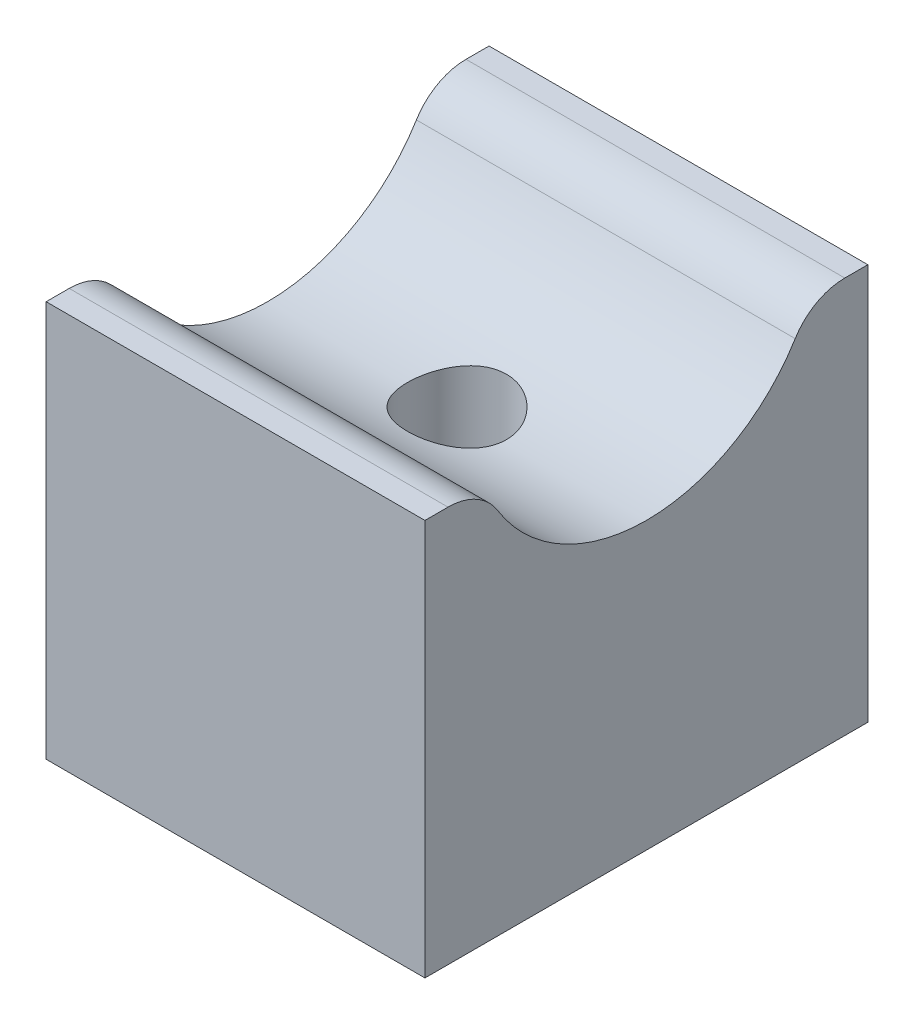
ISO-10303-21;
HEADER;
FILE_DESCRIPTION(('STEP AP214'),'2;1');
FILE_NAME('part.step','',(''),(''),'','','');
FILE_SCHEMA(('AUTOMOTIVE_DESIGN { 1 0 10303 214 1 1 1 1 }'));
ENDSEC;
DATA;
#1=APPLICATION_CONTEXT('core data for automotive mechanical design processes');
#2=APPLICATION_PROTOCOL_DEFINITION('international standard','automotive_design',2000,#1);
#3=PRODUCT_CONTEXT('',#1,'mechanical');
#4=PRODUCT('Part','Part','',(#3));
#5=PRODUCT_RELATED_PRODUCT_CATEGORY('part','',(#4));
#6=PRODUCT_DEFINITION_FORMATION('','',#4);
#7=PRODUCT_DEFINITION_CONTEXT('part definition',#1,'design');
#8=PRODUCT_DEFINITION('design','',#6,#7);
#9=PRODUCT_DEFINITION_SHAPE('','',#8);
#10=(LENGTH_UNIT() NAMED_UNIT(*) SI_UNIT(.MILLI.,.METRE.));
#11=(NAMED_UNIT(*) PLANE_ANGLE_UNIT() SI_UNIT($,.RADIAN.));
#12=(NAMED_UNIT(*) SI_UNIT($,.STERADIAN.) SOLID_ANGLE_UNIT());
#13=UNCERTAINTY_MEASURE_WITH_UNIT(LENGTH_MEASURE(1.E-05),#10,'distance_accuracy_value','');
#14=(GEOMETRIC_REPRESENTATION_CONTEXT(3) GLOBAL_UNCERTAINTY_ASSIGNED_CONTEXT((#13)) GLOBAL_UNIT_ASSIGNED_CONTEXT((#10,
#11,#12)) REPRESENTATION_CONTEXT('',''));
#15=CARTESIAN_POINT('',(0.,0.,0.));
#16=DIRECTION('',(0.,0.,1.));
#17=DIRECTION('',(1.,0.,0.));
#18=AXIS2_PLACEMENT_3D('',#15,#16,#17);
#19=CARTESIAN_POINT('',(16.25,34.,19.));
#20=DIRECTION('',(0.,1.,0.));
#21=DIRECTION('',(0.,0.,1.));
#22=AXIS2_PLACEMENT_3D('',#19,#20,#21);
#23=PLANE('',#22);
#24=DIRECTION('',(0.,0.,-1.));
#25=VECTOR('',#24,1.);
#26=CARTESIAN_POINT('',(16.25,34.,-19.));
#27=LINE('',#26,#25);
#28=CARTESIAN_POINT('',(16.25,34.,19.));
#29=VERTEX_POINT('',#28);
#30=CARTESIAN_POINT('',(16.25,34.,17.0220445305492));
#31=VERTEX_POINT('',#30);
#32=EDGE_CURVE('E109',#29,#31,#27,.T.);
#33=ORIENTED_EDGE('',*,*,#32,.T.);
#34=DIRECTION('',(-1.,0.,0.));
#35=VECTOR('',#34,1.);
#36=CARTESIAN_POINT('',(-16.25,34.,17.0220445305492));
#37=LINE('',#36,#35);
#38=CARTESIAN_POINT('',(-16.25,34.,17.0220445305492));
#39=VERTEX_POINT('',#38);
#40=EDGE_CURVE('E11',#31,#39,#37,.T.);
#41=ORIENTED_EDGE('',*,*,#40,.T.);
#42=DIRECTION('',(0.,0.,1.));
#43=VECTOR('',#42,1.);
#44=CARTESIAN_POINT('',(-16.25,34.,-19.));
#45=LINE('',#44,#43);
#46=CARTESIAN_POINT('',(-16.25,34.,19.));
#47=VERTEX_POINT('',#46);
#48=EDGE_CURVE('E120',#39,#47,#45,.T.);
#49=ORIENTED_EDGE('',*,*,#48,.T.);
#50=DIRECTION('',(1.,0.,0.));
#51=VECTOR('',#50,1.);
#52=CARTESIAN_POINT('',(-16.25,34.,19.));
#53=LINE('',#52,#51);
#54=EDGE_CURVE('E158',#47,#29,#53,.T.);
#55=ORIENTED_EDGE('',*,*,#54,.T.);
#56=EDGE_LOOP('',(#33,#41,#49,#55));
#57=FACE_BOUND('',#56,.T.);
#58=ADVANCED_FACE('F34',(#57),#23,.T.);
#59=CARTESIAN_POINT('',(16.25,34.,-19.));
#60=DIRECTION('',(-1.,0.,0.));
#61=DIRECTION('',(0.,0.,1.));
#62=AXIS2_PLACEMENT_3D('',#59,#60,#61);
#63=PLANE('',#62);
#64=CARTESIAN_POINT('',(16.25,34.,-17.0220445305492));
#65=VERTEX_POINT('',#64);
#66=CARTESIAN_POINT('',(16.25,34.,-19.));
#67=VERTEX_POINT('',#66);
#68=EDGE_CURVE('E102',#65,#67,#27,.T.);
#69=ORIENTED_EDGE('',*,*,#68,.F.);
#70=CARTESIAN_POINT('',(16.25,29.,-17.0220445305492));
#71=DIRECTION('',(-1.,0.,0.));
#72=DIRECTION('',(0.,0.,1.));
#73=AXIS2_PLACEMENT_3D('',#70,#71,#72);
#74=CIRCLE('',#73,5.);
#75=CARTESIAN_POINT('',(16.25,31.625,-12.7665333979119));
#76=VERTEX_POINT('',#75);
#77=EDGE_CURVE('E47',#65,#76,#74,.F.);
#78=ORIENTED_EDGE('',*,*,#77,.T.);
#79=CARTESIAN_POINT('',(16.25,39.5,0.));
#80=DIRECTION('',(1.,0.,0.));
#81=DIRECTION('',(0.,0.,-1.));
#82=AXIS2_PLACEMENT_3D('',#79,#80,#81);
#83=CIRCLE('',#82,15.);
#84=CARTESIAN_POINT('',(16.25,31.625,12.7665333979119));
#85=VERTEX_POINT('',#84);
#86=EDGE_CURVE('E144',#85,#76,#83,.T.);
#87=ORIENTED_EDGE('',*,*,#86,.F.);
#88=CARTESIAN_POINT('',(16.25,29.,17.0220445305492));
#89=DIRECTION('',(-1.,0.,0.));
#90=DIRECTION('',(0.,0.,1.));
#91=AXIS2_PLACEMENT_3D('',#88,#89,#90);
#92=CIRCLE('',#91,5.);
#93=EDGE_CURVE('E54',#85,#31,#92,.F.);
#94=ORIENTED_EDGE('',*,*,#93,.T.);
#95=ORIENTED_EDGE('',*,*,#32,.F.);
#96=DIRECTION('',(0.,-1.,0.));
#97=VECTOR('',#96,1.);
#98=CARTESIAN_POINT('',(16.25,34.,19.));
#99=LINE('',#98,#97);
#100=CARTESIAN_POINT('',(16.25,0.,19.));
#101=VERTEX_POINT('',#100);
#102=EDGE_CURVE('E160',#29,#101,#99,.T.);
#103=ORIENTED_EDGE('',*,*,#102,.T.);
#104=DIRECTION('',(0.,0.,-1.));
#105=VECTOR('',#104,1.);
#106=CARTESIAN_POINT('',(16.25,0.,-19.));
#107=LINE('',#106,#105);
#108=CARTESIAN_POINT('',(16.25,0.,-19.));
#109=VERTEX_POINT('',#108);
#110=EDGE_CURVE('E125',#101,#109,#107,.T.);
#111=ORIENTED_EDGE('',*,*,#110,.T.);
#112=DIRECTION('',(0.,-1.,0.));
#113=VECTOR('',#112,1.);
#114=CARTESIAN_POINT('',(16.25,34.,-19.));
#115=LINE('',#114,#113);
#116=EDGE_CURVE('E115',#67,#109,#115,.T.);
#117=ORIENTED_EDGE('',*,*,#116,.F.);
#118=EDGE_LOOP('',(#69,#78,#87,#94,#95,#103,#111,#117));
#119=FACE_BOUND('',#118,.T.);
#120=ADVANCED_FACE('F122',(#119),#63,.F.);
#121=CARTESIAN_POINT('',(-16.25,34.,-19.));
#122=DIRECTION('',(0.,0.,1.));
#123=DIRECTION('',(1.,0.,0.));
#124=AXIS2_PLACEMENT_3D('',#121,#122,#123);
#125=PLANE('',#124);
#126=DIRECTION('',(-1.,0.,0.));
#127=VECTOR('',#126,1.);
#128=CARTESIAN_POINT('',(-16.25,0.,-19.));
#129=LINE('',#128,#127);
#130=CARTESIAN_POINT('',(-16.25,0.,-19.));
#131=VERTEX_POINT('',#130);
#132=EDGE_CURVE('E164',#109,#131,#129,.T.);
#133=ORIENTED_EDGE('',*,*,#132,.T.);
#134=DIRECTION('',(0.,-1.,0.));
#135=VECTOR('',#134,1.);
#136=CARTESIAN_POINT('',(-16.25,34.,-19.));
#137=LINE('',#136,#135);
#138=CARTESIAN_POINT('',(-16.25,34.,-19.));
#139=VERTEX_POINT('',#138);
#140=EDGE_CURVE('E118',#139,#131,#137,.T.);
#141=ORIENTED_EDGE('',*,*,#140,.F.);
#142=DIRECTION('',(-1.,0.,0.));
#143=VECTOR('',#142,1.);
#144=CARTESIAN_POINT('',(-16.25,34.,-19.));
#145=LINE('',#144,#143);
#146=EDGE_CURVE('E105',#67,#139,#145,.T.);
#147=ORIENTED_EDGE('',*,*,#146,.F.);
#148=ORIENTED_EDGE('',*,*,#116,.T.);
#149=EDGE_LOOP('',(#133,#141,#147,#148));
#150=FACE_BOUND('',#149,.T.);
#151=ADVANCED_FACE('F114',(#150),#125,.F.);
#152=CARTESIAN_POINT('',(-16.25,34.,-19.));
#153=DIRECTION('',(1.,0.,0.));
#154=DIRECTION('',(0.,0.,-1.));
#155=AXIS2_PLACEMENT_3D('',#152,#153,#154);
#156=PLANE('',#155);
#157=CARTESIAN_POINT('',(-16.25,39.5,0.));
#158=DIRECTION('',(1.,0.,0.));
#159=DIRECTION('',(0.,0.,-1.));
#160=AXIS2_PLACEMENT_3D('',#157,#158,#159);
#161=CIRCLE('',#160,15.);
#162=CARTESIAN_POINT('',(-16.25,31.625,12.7665333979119));
#163=VERTEX_POINT('',#162);
#164=CARTESIAN_POINT('',(-16.25,31.625,-12.7665333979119));
#165=VERTEX_POINT('',#164);
#166=EDGE_CURVE('E152',#163,#165,#161,.T.);
#167=ORIENTED_EDGE('',*,*,#166,.T.);
#168=CARTESIAN_POINT('',(-16.25,29.,-17.0220445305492));
#169=DIRECTION('',(1.,0.,0.));
#170=DIRECTION('',(0.,0.,-1.));
#171=AXIS2_PLACEMENT_3D('',#168,#169,#170);
#172=CIRCLE('',#171,5.);
#173=CARTESIAN_POINT('',(-16.25,34.,-17.0220445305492));
#174=VERTEX_POINT('',#173);
#175=EDGE_CURVE('E139',#165,#174,#172,.F.);
#176=ORIENTED_EDGE('',*,*,#175,.T.);
#177=EDGE_CURVE('E157',#139,#174,#45,.T.);
#178=ORIENTED_EDGE('',*,*,#177,.F.);
#179=ORIENTED_EDGE('',*,*,#140,.T.);
#180=DIRECTION('',(0.,0.,1.));
#181=VECTOR('',#180,1.);
#182=CARTESIAN_POINT('',(-16.25,0.,-19.));
#183=LINE('',#182,#181);
#184=CARTESIAN_POINT('',(-16.25,0.,19.));
#185=VERTEX_POINT('',#184);
#186=EDGE_CURVE('E166',#131,#185,#183,.T.);
#187=ORIENTED_EDGE('',*,*,#186,.T.);
#188=DIRECTION('',(0.,-1.,0.));
#189=VECTOR('',#188,1.);
#190=CARTESIAN_POINT('',(-16.25,34.,19.));
#191=LINE('',#190,#189);
#192=EDGE_CURVE('E131',#47,#185,#191,.T.);
#193=ORIENTED_EDGE('',*,*,#192,.F.);
#194=ORIENTED_EDGE('',*,*,#48,.F.);
#195=CARTESIAN_POINT('',(-16.25,29.,17.0220445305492));
#196=DIRECTION('',(1.,0.,0.));
#197=DIRECTION('',(0.,0.,-1.));
#198=AXIS2_PLACEMENT_3D('',#195,#196,#197);
#199=CIRCLE('',#198,5.);
#200=EDGE_CURVE('E137',#39,#163,#199,.F.);
#201=ORIENTED_EDGE('',*,*,#200,.T.);
#202=EDGE_LOOP('',(#167,#176,#178,#179,#187,#193,#194,#201));
#203=FACE_BOUND('',#202,.T.);
#204=ADVANCED_FACE('F156',(#203),#156,.F.);
#205=CARTESIAN_POINT('',(-16.25,34.,19.));
#206=DIRECTION('',(0.,0.,-1.));
#207=DIRECTION('',(-1.,0.,0.));
#208=AXIS2_PLACEMENT_3D('',#205,#206,#207);
#209=PLANE('',#208);
#210=DIRECTION('',(1.,0.,0.));
#211=VECTOR('',#210,1.);
#212=CARTESIAN_POINT('',(-16.25,0.,19.));
#213=LINE('',#212,#211);
#214=EDGE_CURVE('E110',#185,#101,#213,.T.);
#215=ORIENTED_EDGE('',*,*,#214,.T.);
#216=ORIENTED_EDGE('',*,*,#102,.F.);
#217=ORIENTED_EDGE('',*,*,#54,.F.);
#218=ORIENTED_EDGE('',*,*,#192,.T.);
#219=EDGE_LOOP('',(#215,#216,#217,#218));
#220=FACE_BOUND('',#219,.T.);
#221=ADVANCED_FACE('F174',(#220),#209,.F.);
#222=ORIENTED_EDGE('',*,*,#177,.T.);
#223=DIRECTION('',(-1.,0.,0.));
#224=VECTOR('',#223,1.);
#225=CARTESIAN_POINT('',(16.25,34.,-17.0220445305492));
#226=LINE('',#225,#224);
#227=EDGE_CURVE('E62',#174,#65,#226,.F.);
#228=ORIENTED_EDGE('',*,*,#227,.T.);
#229=ORIENTED_EDGE('',*,*,#68,.T.);
#230=ORIENTED_EDGE('',*,*,#146,.T.);
#231=EDGE_LOOP('',(#222,#228,#229,#230));
#232=FACE_BOUND('',#231,.T.);
#233=ADVANCED_FACE('F104',(#232),#23,.T.);
#234=CARTESIAN_POINT('',(16.25,0.,19.));
#235=DIRECTION('',(0.,1.,0.));
#236=DIRECTION('',(0.,0.,1.));
#237=AXIS2_PLACEMENT_3D('',#234,#235,#236);
#238=PLANE('',#237);
#239=CARTESIAN_POINT('',(0.,0.,0.));
#240=DIRECTION('',(0.,-1.,0.));
#241=DIRECTION('',(0.,0.,-1.));
#242=AXIS2_PLACEMENT_3D('',#239,#240,#241);
#243=CIRCLE('',#242,7.5);
#244=CARTESIAN_POINT('',(0.,0.,-7.5));
#245=VERTEX_POINT('',#244);
#246=EDGE_CURVE('E217',#245,#245,#243,.T.);
#247=ORIENTED_EDGE('',*,*,#246,.F.);
#248=EDGE_LOOP('',(#247));
#249=FACE_BOUND('',#248,.T.);
#250=ORIENTED_EDGE('',*,*,#110,.F.);
#251=ORIENTED_EDGE('',*,*,#214,.F.);
#252=ORIENTED_EDGE('',*,*,#186,.F.);
#253=ORIENTED_EDGE('',*,*,#132,.F.);
#254=EDGE_LOOP('',(#250,#251,#252,#253));
#255=FACE_BOUND('',#254,.T.);
#256=ADVANCED_FACE('F179',(#249,#255),#238,.F.);
#257=CARTESIAN_POINT('',(-16.25,39.5,0.));
#258=DIRECTION('',(1.,0.,0.));
#259=DIRECTION('',(0.,0.,-1.));
#260=AXIS2_PLACEMENT_3D('',#257,#258,#259);
#261=CYLINDRICAL_SURFACE('',#260,15.);
#262=CARTESIAN_POINT('',(0.,25.1146776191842,-4.25));
#263=CARTESIAN_POINT('',(0.233523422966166,25.1146742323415,-4.24999559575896));
#264=CARTESIAN_POINT('',(0.467091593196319,25.1089290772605,-4.23068745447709));
#265=CARTESIAN_POINT('',(0.927442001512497,25.0866489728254,-4.1541366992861));
#266=CARTESIAN_POINT('',(1.15422135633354,25.0701095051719,-4.09687819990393));
#267=CARTESIAN_POINT('',(1.59426622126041,25.0282610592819,-3.94649274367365));
#268=CARTESIAN_POINT('',(1.80755182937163,25.0029655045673,-3.85342066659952));
#269=CARTESIAN_POINT('',(2.21552443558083,24.9464726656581,-3.63422631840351));
#270=CARTESIAN_POINT('',(2.41020931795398,24.9152747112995,-3.50810029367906));
#271=CARTESIAN_POINT('',(2.78094944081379,24.8495049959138,-3.22256871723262));
#272=CARTESIAN_POINT('',(2.95640188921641,24.8148674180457,-3.06239547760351));
#273=CARTESIAN_POINT('',(3.27834850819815,24.7466864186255,-2.71496442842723));
#274=CARTESIAN_POINT('',(3.42483933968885,24.7131431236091,-2.52770350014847));
#275=CARTESIAN_POINT('',(3.68726839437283,24.6501892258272,-2.12718013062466));
#276=CARTESIAN_POINT('',(3.80259987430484,24.6208652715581,-1.91350533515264));
#277=CARTESIAN_POINT('',(3.99546656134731,24.5704138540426,-1.46882520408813));
#278=CARTESIAN_POINT('',(4.07300899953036,24.5492848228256,-1.23782319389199));
#279=CARTESIAN_POINT('',(4.18612422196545,24.518069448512,-0.771345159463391));
#280=CARTESIAN_POINT('',(4.22272414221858,24.5077133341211,-0.536136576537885));
#281=CARTESIAN_POINT('',(4.2561548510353,24.4982641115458,-0.0627048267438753));
#282=CARTESIAN_POINT('',(4.25299311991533,24.4991688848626,0.17551776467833));
#283=CARTESIAN_POINT('',(4.2076971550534,24.5119452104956,0.64103860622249));
#284=CARTESIAN_POINT('',(4.16667385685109,24.5235041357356,0.868454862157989));
#285=CARTESIAN_POINT('',(4.04862369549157,24.5559157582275,1.3130322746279));
#286=CARTESIAN_POINT('',(3.97159465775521,24.5767690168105,1.53019281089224));
#287=CARTESIAN_POINT('',(3.7829170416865,24.6258745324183,1.95083500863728));
#288=CARTESIAN_POINT('',(3.67090316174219,24.6542043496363,2.15414338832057));
#289=CARTESIAN_POINT('',(3.41571984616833,24.7152332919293,2.53944525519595));
#290=CARTESIAN_POINT('',(3.27254367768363,24.7479333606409,2.72143412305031));
#291=CARTESIAN_POINT('',(2.95326728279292,24.8155128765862,3.06556343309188));
#292=CARTESIAN_POINT('',(2.77620085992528,24.8504285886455,3.22680146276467));
#293=CARTESIAN_POINT('',(2.39718879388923,24.917500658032,3.5175324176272));
#294=CARTESIAN_POINT('',(2.19524120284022,24.949656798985,3.64702285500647));
#295=CARTESIAN_POINT('',(1.77004064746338,25.0077286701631,3.87139073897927));
#296=CARTESIAN_POINT('',(1.54663493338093,25.0335941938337,3.96599263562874));
#297=CARTESIAN_POINT('',(1.08616805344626,25.0755482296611,4.11598413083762));
#298=CARTESIAN_POINT('',(0.849110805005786,25.0916395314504,4.17138491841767));
#299=CARTESIAN_POINT('',(0.376583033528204,25.1116200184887,4.23978267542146));
#300=CARTESIAN_POINT('',(0.141325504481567,25.1159000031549,4.25413830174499));
#301=CARTESIAN_POINT('',(-0.328234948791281,25.1128481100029,4.2438064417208));
#302=CARTESIAN_POINT('',(-0.562537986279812,25.105517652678,4.21912373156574));
#303=CARTESIAN_POINT('',(-1.01809657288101,25.0804513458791,4.13261985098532));
#304=CARTESIAN_POINT('',(-1.23952685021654,25.0629523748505,4.07164339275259));
#305=CARTESIAN_POINT('',(-1.66900918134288,25.0197589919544,3.91524700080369));
#306=CARTESIAN_POINT('',(-1.87705932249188,24.9940634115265,3.81982215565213));
#307=CARTESIAN_POINT('',(-2.27948293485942,24.9365916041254,3.59456841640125));
#308=CARTESIAN_POINT('',(-2.47339895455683,24.9046823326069,3.46395703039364));
#309=CARTESIAN_POINT('',(-2.83705912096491,24.8386779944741,3.17298767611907));
#310=CARTESIAN_POINT('',(-3.0067981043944,24.804582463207,3.01262337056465));
#311=CARTESIAN_POINT('',(-3.3230722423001,24.7366797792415,2.66036524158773));
#312=CARTESIAN_POINT('',(-3.46865211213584,24.7029196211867,2.46760271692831));
#313=CARTESIAN_POINT('',(-3.72540355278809,24.6406403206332,2.05959985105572));
#314=CARTESIAN_POINT('',(-3.83657693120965,24.6121209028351,1.84436069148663));
#315=CARTESIAN_POINT('',(-4.02030195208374,24.5637186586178,1.39901069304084));
#316=CARTESIAN_POINT('',(-4.09314591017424,24.5437706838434,1.16902787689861));
#317=CARTESIAN_POINT('',(-4.19895126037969,24.5144712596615,0.699427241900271));
#318=CARTESIAN_POINT('',(-4.23192272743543,24.5051171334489,0.459811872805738));
#319=CARTESIAN_POINT('',(-4.25634936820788,24.4982036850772,-0.0133761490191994));
#320=CARTESIAN_POINT('',(-4.24919766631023,24.5002485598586,-0.246872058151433));
#321=CARTESIAN_POINT('',(-4.19686217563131,24.5149898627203,-0.709199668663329));
#322=CARTESIAN_POINT('',(-4.15168015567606,24.5276857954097,-0.938031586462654));
#323=CARTESIAN_POINT('',(-4.02539277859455,24.5622068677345,-1.38263253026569));
#324=CARTESIAN_POINT('',(-3.94460198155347,24.5839519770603,-1.59849753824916));
#325=CARTESIAN_POINT('',(-3.74967016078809,24.6343116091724,-2.01372839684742));
#326=CARTESIAN_POINT('',(-3.63552403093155,24.66292718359,-2.21309171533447));
#327=CARTESIAN_POINT('',(-3.37322491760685,24.7250389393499,-2.59601249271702));
#328=CARTESIAN_POINT('',(-3.22417200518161,24.7586537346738,-2.77893415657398));
#329=CARTESIAN_POINT('',(-2.89795483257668,24.826546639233,-3.11763798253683));
#330=CARTESIAN_POINT('',(-2.72078285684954,24.8608249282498,-3.2734126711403));
#331=CARTESIAN_POINT('',(-2.33788332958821,24.9271897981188,-3.55739493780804));
#332=CARTESIAN_POINT('',(-2.13153881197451,24.959197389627,-3.68479095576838));
#333=CARTESIAN_POINT('',(-1.6994799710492,25.0162146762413,-3.9029158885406));
#334=CARTESIAN_POINT('',(-1.47377681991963,25.0412283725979,-3.99366578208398));
#335=CARTESIAN_POINT('',(-1.04119156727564,25.0784308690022,-4.12581838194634));
#336=CARTESIAN_POINT('',(-0.835949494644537,25.0919047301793,-4.17226825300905));
#337=CARTESIAN_POINT('',(-0.420483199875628,25.1100289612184,-4.23435870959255));
#338=CARTESIAN_POINT('',(-0.210259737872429,25.1146806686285,-4.250003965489));
#339=CARTESIAN_POINT('',(0.,25.1146776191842,-4.25));
#340=B_SPLINE_CURVE_WITH_KNOTS('',3,(#262,#263,#264,#265,#266,#267,#268,#269,#270,#271,#272,
#273,#274,#275,#276,#277,#278,#279,#280,#281,#282,#283,#284,#285,#286,#287,#288,#289,#290,#291,
#292,#293,#294,#295,#296,#297,#298,#299,#300,#301,#302,#303,#304,#305,#306,#307,#308,#309,#310,
#311,#312,#313,#314,#315,#316,#317,#318,#319,#320,#321,#322,#323,#324,#325,#326,#327,#328,#329,
#330,#331,#332,#333,#334,#335,#336,#337,#338,#339),.UNSPECIFIED.,.T.,.F.,(4,2,2,2,2,2,2,2,2,2,2,
2,2,2,2,2,2,2,2,2,2,2,2,2,2,2,2,2,2,2,2,2,2,2,2,2,2,2,4),(0.,0.699795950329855,1.39988501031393,
2.09890551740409,2.79800543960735,3.51496036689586,4.23199790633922,4.9621287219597,
5.69211976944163,6.40335519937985,7.11445682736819,7.80533472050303,8.49625434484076,
9.19464418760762,9.89318507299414,10.6158478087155,11.3385671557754,12.0668781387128,
12.7949811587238,13.498687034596,14.2023068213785,14.89015768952,15.5781066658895,
16.2828380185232,16.9877196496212,17.715958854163,18.4441597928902,19.1667235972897,
19.8891047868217,20.5865627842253,21.2839883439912,21.9753727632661,22.6668630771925,
23.3786525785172,24.0906377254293,24.8209248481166,25.5507933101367,26.180970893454,
26.8110529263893),.UNSPECIFIED.);
#341=CARTESIAN_POINT('',(0.,25.1146776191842,-4.25));
#342=VERTEX_POINT('',#341);
#343=EDGE_CURVE('E38',#342,#342,#340,.T.);
#344=ORIENTED_EDGE('',*,*,#343,.T.);
#345=EDGE_LOOP('',(#344));
#346=FACE_BOUND('',#345,.T.);
#347=ORIENTED_EDGE('',*,*,#86,.T.);
#348=DIRECTION('',(1.,0.,0.));
#349=VECTOR('',#348,1.);
#350=CARTESIAN_POINT('',(-16.25,31.625,-12.7665333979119));
#351=LINE('',#350,#349);
#352=EDGE_CURVE('E129',#76,#165,#351,.F.);
#353=ORIENTED_EDGE('',*,*,#352,.T.);
#354=ORIENTED_EDGE('',*,*,#166,.F.);
#355=DIRECTION('',(1.,0.,0.));
#356=VECTOR('',#355,1.);
#357=CARTESIAN_POINT('',(-16.25,31.625,12.7665333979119));
#358=LINE('',#357,#356);
#359=EDGE_CURVE('E126',#163,#85,#358,.T.);
#360=ORIENTED_EDGE('',*,*,#359,.T.);
#361=EDGE_LOOP('',(#347,#353,#354,#360));
#362=FACE_BOUND('',#361,.T.);
#363=ADVANCED_FACE('F148',(#346,#362),#261,.F.);
#364=CARTESIAN_POINT('',(-16.25,29.,-17.0220445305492));
#365=DIRECTION('',(1.,0.,0.));
#366=DIRECTION('',(0.,0.,-1.));
#367=AXIS2_PLACEMENT_3D('',#364,#365,#366);
#368=CYLINDRICAL_SURFACE('',#367,5.);
#369=ORIENTED_EDGE('',*,*,#77,.F.);
#370=ORIENTED_EDGE('',*,*,#227,.F.);
#371=ORIENTED_EDGE('',*,*,#175,.F.);
#372=ORIENTED_EDGE('',*,*,#352,.F.);
#373=EDGE_LOOP('',(#369,#370,#371,#372));
#374=FACE_BOUND('',#373,.T.);
#375=ADVANCED_FACE('F154',(#374),#368,.T.);
#376=CARTESIAN_POINT('',(-16.25,29.,17.0220445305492));
#377=DIRECTION('',(1.,0.,0.));
#378=DIRECTION('',(0.,0.,-1.));
#379=AXIS2_PLACEMENT_3D('',#376,#377,#378);
#380=CYLINDRICAL_SURFACE('',#379,5.);
#381=ORIENTED_EDGE('',*,*,#200,.F.);
#382=ORIENTED_EDGE('',*,*,#40,.F.);
#383=ORIENTED_EDGE('',*,*,#93,.F.);
#384=ORIENTED_EDGE('',*,*,#359,.F.);
#385=EDGE_LOOP('',(#381,#382,#383,#384));
#386=FACE_BOUND('',#385,.T.);
#387=ADVANCED_FACE('F36',(#386),#380,.T.);
#388=CARTESIAN_POINT('',(0.,0.,0.));
#389=DIRECTION('',(0.,-1.,0.));
#390=DIRECTION('',(0.,0.,-1.));
#391=AXIS2_PLACEMENT_3D('',#388,#389,#390);
#392=CYLINDRICAL_SURFACE('',#391,4.25);
#393=CARTESIAN_POINT('',(0.,2.,0.));
#394=DIRECTION('',(0.,-1.,0.));
#395=DIRECTION('',(0.,0.,-1.));
#396=AXIS2_PLACEMENT_3D('',#393,#394,#395);
#397=CIRCLE('',#396,4.25);
#398=CARTESIAN_POINT('',(0.,2.,-4.25));
#399=VERTEX_POINT('',#398);
#400=EDGE_CURVE('E219',#399,#399,#397,.T.);
#401=ORIENTED_EDGE('',*,*,#400,.T.);
#402=EDGE_LOOP('',(#401));
#403=FACE_BOUND('',#402,.T.);
#404=ORIENTED_EDGE('',*,*,#343,.F.);
#405=EDGE_LOOP('',(#404));
#406=FACE_BOUND('',#405,.T.);
#407=ADVANCED_FACE('F198',(#403,#406),#392,.F.);
#408=CARTESIAN_POINT('',(4.25,2.,0.));
#409=DIRECTION('',(0.,1.,0.));
#410=DIRECTION('',(0.,0.,1.));
#411=AXIS2_PLACEMENT_3D('',#408,#409,#410);
#412=PLANE('',#411);
#413=ORIENTED_EDGE('',*,*,#400,.F.);
#414=EDGE_LOOP('',(#413));
#415=FACE_BOUND('',#414,.T.);
#416=CARTESIAN_POINT('',(0.,2.,0.));
#417=DIRECTION('',(0.,-1.,0.));
#418=DIRECTION('',(0.,0.,-1.));
#419=AXIS2_PLACEMENT_3D('',#416,#417,#418);
#420=CIRCLE('',#419,7.5);
#421=CARTESIAN_POINT('',(0.,2.,-7.5));
#422=VERTEX_POINT('',#421);
#423=EDGE_CURVE('E215',#422,#422,#420,.T.);
#424=ORIENTED_EDGE('',*,*,#423,.T.);
#425=EDGE_LOOP('',(#424));
#426=FACE_BOUND('',#425,.T.);
#427=ADVANCED_FACE('F202',(#415,#426),#412,.F.);
#428=CARTESIAN_POINT('',(0.,0.,0.));
#429=DIRECTION('',(0.,-1.,0.));
#430=DIRECTION('',(0.,0.,-1.));
#431=AXIS2_PLACEMENT_3D('',#428,#429,#430);
#432=CYLINDRICAL_SURFACE('',#431,7.5);
#433=ORIENTED_EDGE('',*,*,#423,.F.);
#434=EDGE_LOOP('',(#433));
#435=FACE_BOUND('',#434,.T.);
#436=ORIENTED_EDGE('',*,*,#246,.T.);
#437=EDGE_LOOP('',(#436));
#438=FACE_BOUND('',#437,.T.);
#439=ADVANCED_FACE('F206',(#435,#438),#432,.F.);
#440=CLOSED_SHELL('',(#58,#120,#151,#204,#221,#233,#256,#363,#375,#387,#407,#427,#439));
#441=MANIFOLD_SOLID_BREP('B2',#440);
#442=ADVANCED_BREP_SHAPE_REPRESENTATION('',(#18,#441),#14);
#443=SHAPE_DEFINITION_REPRESENTATION(#9,#442);
ENDSEC;
END-ISO-10303-21;
